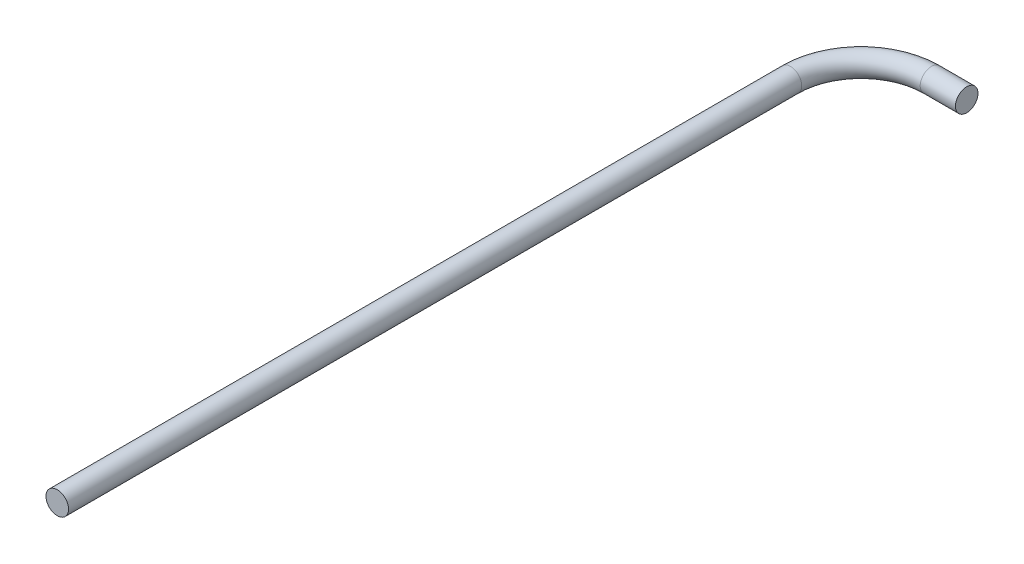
ISO-10303-21;
HEADER;
FILE_DESCRIPTION(('STEP AP214'),'2;1');
FILE_NAME('part.step','',(''),(''),'','','');
FILE_SCHEMA(('AUTOMOTIVE_DESIGN { 1 0 10303 214 1 1 1 1 }'));
ENDSEC;
DATA;
#1=APPLICATION_CONTEXT('core data for automotive mechanical design processes');
#2=APPLICATION_PROTOCOL_DEFINITION('international standard','automotive_design',2000,#1);
#3=PRODUCT_CONTEXT('',#1,'mechanical');
#4=PRODUCT('Part','Part','',(#3));
#5=PRODUCT_RELATED_PRODUCT_CATEGORY('part','',(#4));
#6=PRODUCT_DEFINITION_FORMATION('','',#4);
#7=PRODUCT_DEFINITION_CONTEXT('part definition',#1,'design');
#8=PRODUCT_DEFINITION('design','',#6,#7);
#9=PRODUCT_DEFINITION_SHAPE('','',#8);
#10=(LENGTH_UNIT() NAMED_UNIT(*) SI_UNIT(.MILLI.,.METRE.));
#11=(NAMED_UNIT(*) PLANE_ANGLE_UNIT() SI_UNIT($,.RADIAN.));
#12=(NAMED_UNIT(*) SI_UNIT($,.STERADIAN.) SOLID_ANGLE_UNIT());
#13=UNCERTAINTY_MEASURE_WITH_UNIT(LENGTH_MEASURE(1.E-05),#10,'distance_accuracy_value','');
#14=(GEOMETRIC_REPRESENTATION_CONTEXT(3) GLOBAL_UNCERTAINTY_ASSIGNED_CONTEXT((#13)) GLOBAL_UNIT_ASSIGNED_CONTEXT((#10,
#11,#12)) REPRESENTATION_CONTEXT('',''));
#15=CARTESIAN_POINT('',(0.,0.,0.));
#16=DIRECTION('',(0.,0.,1.));
#17=DIRECTION('',(1.,0.,0.));
#18=AXIS2_PLACEMENT_3D('',#15,#16,#17);
#19=CARTESIAN_POINT('',(5.00000000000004,0.,-57.));
#20=DIRECTION('',(1.,0.,0.));
#21=DIRECTION('',(0.,0.,-1.));
#22=AXIS2_PLACEMENT_3D('',#19,#20,#21);
#23=CYLINDRICAL_SURFACE('',#22,0.8);
#24=CARTESIAN_POINT('',(5.00000000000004,0.,-57.));
#25=DIRECTION('',(-1.,0.,0.));
#26=DIRECTION('',(0.,0.,1.));
#27=AXIS2_PLACEMENT_3D('',#24,#25,#26);
#28=CIRCLE('',#27,0.8);
#29=CARTESIAN_POINT('',(5.00000000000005,0.,-57.8));
#30=VERTEX_POINT('',#29);
#31=EDGE_CURVE('E36',#30,#30,#28,.T.);
#32=ORIENTED_EDGE('',*,*,#31,.F.);
#33=EDGE_LOOP('',(#32));
#34=FACE_BOUND('',#33,.T.);
#35=CARTESIAN_POINT('',(7.5,0.,-57.));
#36=DIRECTION('',(-1.,0.,0.));
#37=DIRECTION('',(0.,0.,1.));
#38=AXIS2_PLACEMENT_3D('',#35,#36,#37);
#39=CIRCLE('',#38,0.8);
#40=CARTESIAN_POINT('',(7.49999999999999,0.,-56.2));
#41=VERTEX_POINT('',#40);
#42=EDGE_CURVE('E10',#41,#41,#39,.T.);
#43=ORIENTED_EDGE('',*,*,#42,.T.);
#44=EDGE_LOOP('',(#43));
#45=FACE_BOUND('',#44,.T.);
#46=ADVANCED_FACE('F30',(#34,#45),#23,.T.);
#47=CARTESIAN_POINT('',(5.,0.,-52.));
#48=DIRECTION('',(0.,-1.,0.));
#49=DIRECTION('',(0.,0.,-1.));
#50=AXIS2_PLACEMENT_3D('',#47,#48,#49);
#51=TOROIDAL_SURFACE('',#50,5.,0.8);
#52=CARTESIAN_POINT('',(0.,0.,-52.));
#53=DIRECTION('',(0.,0.,1.));
#54=DIRECTION('',(1.,0.,0.));
#55=AXIS2_PLACEMENT_3D('',#52,#53,#54);
#56=CIRCLE('',#55,0.8);
#57=CARTESIAN_POINT('',(-0.8,0.,-52.));
#58=VERTEX_POINT('',#57);
#59=EDGE_CURVE('E40',#58,#58,#56,.T.);
#60=CARTESIAN_POINT('',(5.,0.,-52.));
#61=DIRECTION('',(0.,-1.,0.));
#62=DIRECTION('',(0.,0.,-1.));
#63=AXIS2_PLACEMENT_3D('',#60,#61,#62);
#64=CIRCLE('',#63,5.8);
#65=EDGE_CURVE('',#58,#30,#64,.T.);
#66=ORIENTED_EDGE('',*,*,#59,.F.);
#67=ORIENTED_EDGE('',*,*,#31,.T.);
#68=ORIENTED_EDGE('',*,*,#65,.T.);
#69=ORIENTED_EDGE('',*,*,#65,.F.);
#70=EDGE_LOOP('',(#66,#68,#67,#69));
#71=FACE_BOUND('',#70,.T.);
#72=ADVANCED_FACE('F55',(#71),#51,.T.);
#73=CARTESIAN_POINT('',(0.,0.,-52.));
#74=DIRECTION('',(0.,0.,1.));
#75=DIRECTION('',(1.,0.,0.));
#76=AXIS2_PLACEMENT_3D('',#73,#74,#75);
#77=CYLINDRICAL_SURFACE('',#76,0.8);
#78=ORIENTED_EDGE('',*,*,#59,.T.);
#79=EDGE_LOOP('',(#78));
#80=FACE_BOUND('',#79,.T.);
#81=CARTESIAN_POINT('',(0.,0.,0.));
#82=DIRECTION('',(0.,0.,1.));
#83=DIRECTION('',(1.,0.,0.));
#84=AXIS2_PLACEMENT_3D('',#81,#82,#83);
#85=CIRCLE('',#84,0.8);
#86=CARTESIAN_POINT('',(0.8,0.,0.));
#87=VERTEX_POINT('',#86);
#88=EDGE_CURVE('E44',#87,#87,#85,.T.);
#89=ORIENTED_EDGE('',*,*,#88,.F.);
#90=EDGE_LOOP('',(#89));
#91=FACE_BOUND('',#90,.T.);
#92=ADVANCED_FACE('F52',(#80,#91),#77,.T.);
#93=CARTESIAN_POINT('',(7.5,0.,-57.));
#94=DIRECTION('',(-1.,0.,0.));
#95=DIRECTION('',(0.,0.,1.));
#96=AXIS2_PLACEMENT_3D('',#93,#94,#95);
#97=PLANE('',#96);
#98=ORIENTED_EDGE('',*,*,#42,.F.);
#99=EDGE_LOOP('',(#98));
#100=FACE_BOUND('',#99,.T.);
#101=ADVANCED_FACE('F54',(#100),#97,.F.);
#102=CARTESIAN_POINT('',(0.,0.,0.));
#103=DIRECTION('',(0.,0.,1.));
#104=DIRECTION('',(1.,0.,0.));
#105=AXIS2_PLACEMENT_3D('',#102,#103,#104);
#106=PLANE('',#105);
#107=ORIENTED_EDGE('',*,*,#88,.T.);
#108=EDGE_LOOP('',(#107));
#109=FACE_BOUND('',#108,.T.);
#110=ADVANCED_FACE('F50',(#109),#106,.T.);
#111=CLOSED_SHELL('',(#46,#72,#92,#101,#110));
#112=MANIFOLD_SOLID_BREP('B2',#111);
#113=ADVANCED_BREP_SHAPE_REPRESENTATION('',(#18,#112),#14);
#114=SHAPE_DEFINITION_REPRESENTATION(#9,#113);
ENDSEC;
END-ISO-10303-21;
